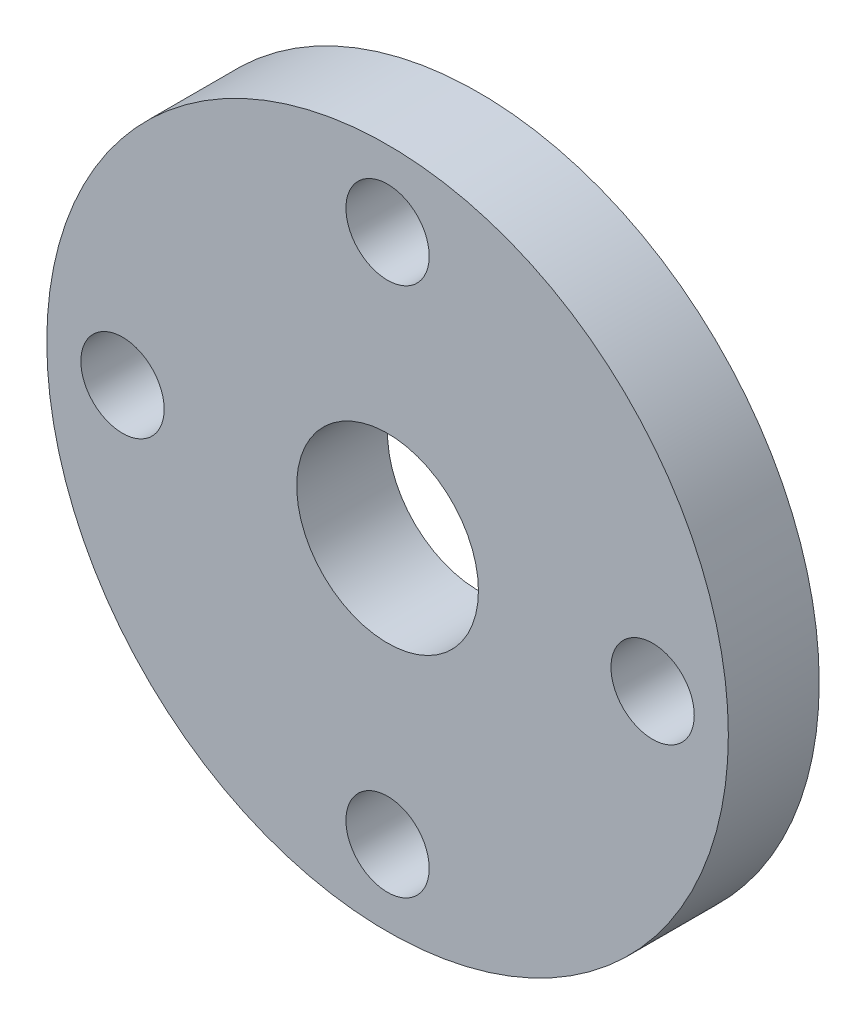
from build123d import *

# Parameters (mm, degrees)
SKETCH1_R           = 22.5
SKETCH1_R_2         = 6
SKETCH1_R_3         = 2.75
BOSS_EXTRUDE1_DEPTH = 6


with BuildPart() as part:
    # Sketch1 → Boss-Extrude1 (new body)
    with BuildSketch(Plane.XY):
        Circle(SKETCH1_R)
        Circle(SKETCH1_R_2, mode=Mode.SUBTRACT)
        with Locations((0, 17.5)):
            Circle(SKETCH1_R_3, mode=Mode.SUBTRACT)
        with Locations((17.5, 0)):
            Circle(SKETCH1_R_3, mode=Mode.SUBTRACT)
        with Locations((0, -17.5)):
            Circle(SKETCH1_R_3, mode=Mode.SUBTRACT)
        with Locations((-17.5, 0)):
            Circle(SKETCH1_R_3, mode=Mode.SUBTRACT)
    extrude(amount=BOSS_EXTRUDE1_DEPTH)


solid = part.part
